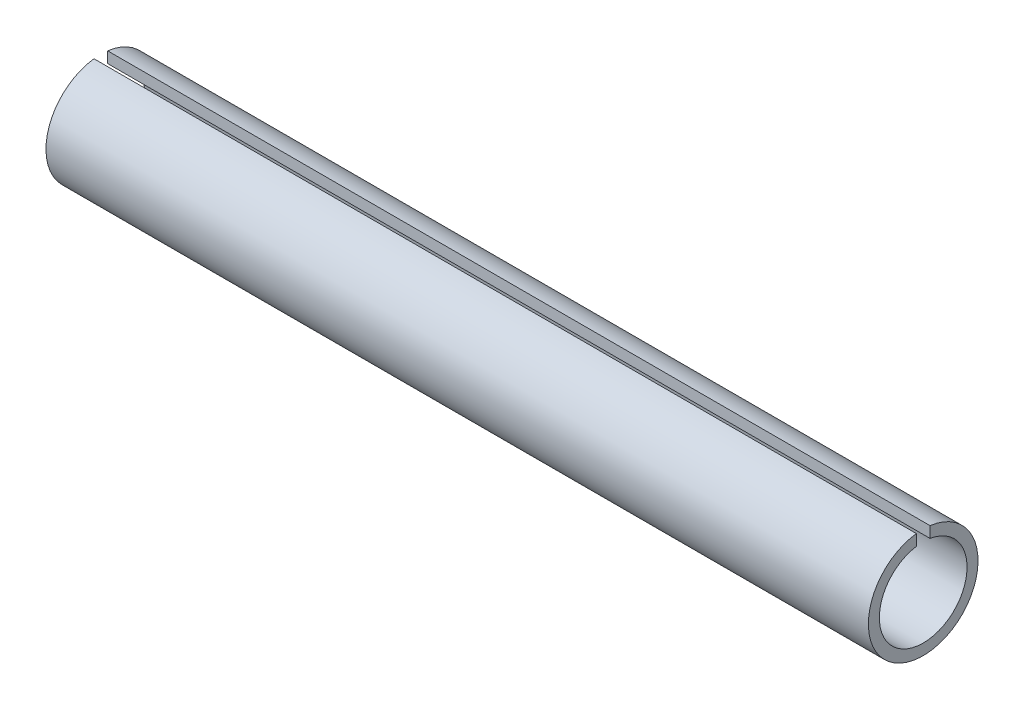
from build123d import *

# Parameters (mm, degrees)
ESQUISSE1_R             = 1
BASE_EXTRUSION_DEPTH    = 15
ESQUISSE2_R             = 0.8
ENL_V_MAT_EXTRU_1_DEPTH = 16.066519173
ESQUISSE3_W             = 0.25
ESQUISSE3_H             = 0.640062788
ENL_V_MAT_EXTRU_2_DEPTH = 16.066519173


with BuildPart() as part:
    # Esquisse1 → Base-Extrusion (new body)
    with BuildSketch(Plane(origin=(0, 0, 0), x_dir=(0, 0, -1), z_dir=(1, 0, 0))):
        Circle(ESQUISSE1_R)
    extrude(amount=BASE_EXTRUSION_DEPTH)

    # Esquisse2 → Enl_v. mat.-Extru.1 (cut, through all)
    with BuildSketch(Plane(origin=(15, 0, 0), x_dir=(0, 0, -1), z_dir=(1, 0, 0))):
        Circle(ESQUISSE2_R)
    extrude(amount=-ENL_V_MAT_EXTRU_1_DEPTH, mode=Mode.SUBTRACT)

    # Esquisse3 → Enl_v. mat.-Extru.2 (cut, through all)
    with BuildSketch(Plane(origin=(15, 0, 0), x_dir=(0, 0, -1), z_dir=(1, 0, 0))):
        with Locations((0, 0.835058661)):
            Rectangle(ESQUISSE3_W, ESQUISSE3_H)
    extrude(amount=-ENL_V_MAT_EXTRU_2_DEPTH, mode=Mode.SUBTRACT)


solid = part.part
